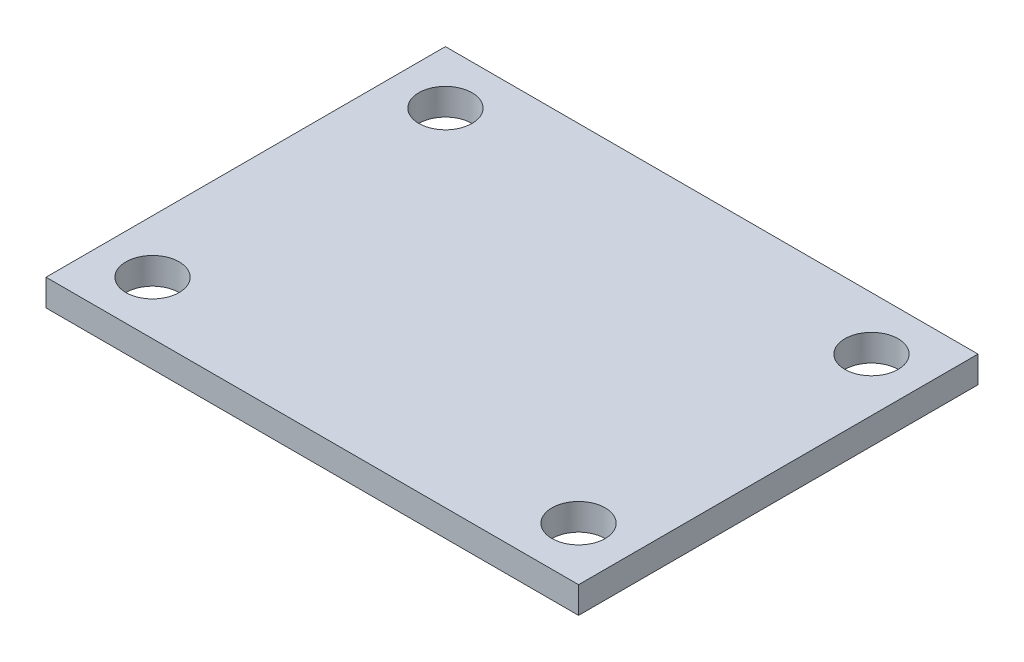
ISO-10303-21;
HEADER;
FILE_DESCRIPTION(('STEP AP214'),'2;1');
FILE_NAME('part.step','',(''),(''),'','','');
FILE_SCHEMA(('AUTOMOTIVE_DESIGN { 1 0 10303 214 1 1 1 1 }'));
ENDSEC;
DATA;
#1=APPLICATION_CONTEXT('core data for automotive mechanical design processes');
#2=APPLICATION_PROTOCOL_DEFINITION('international standard','automotive_design',2000,#1);
#3=PRODUCT_CONTEXT('',#1,'mechanical');
#4=PRODUCT('Part','Part','',(#3));
#5=PRODUCT_RELATED_PRODUCT_CATEGORY('part','',(#4));
#6=PRODUCT_DEFINITION_FORMATION('','',#4);
#7=PRODUCT_DEFINITION_CONTEXT('part definition',#1,'design');
#8=PRODUCT_DEFINITION('design','',#6,#7);
#9=PRODUCT_DEFINITION_SHAPE('','',#8);
#10=(LENGTH_UNIT() NAMED_UNIT(*) SI_UNIT(.MILLI.,.METRE.));
#11=(NAMED_UNIT(*) PLANE_ANGLE_UNIT() SI_UNIT($,.RADIAN.));
#12=(NAMED_UNIT(*) SI_UNIT($,.STERADIAN.) SOLID_ANGLE_UNIT());
#13=UNCERTAINTY_MEASURE_WITH_UNIT(LENGTH_MEASURE(1.E-05),#10,'distance_accuracy_value','');
#14=(GEOMETRIC_REPRESENTATION_CONTEXT(3) GLOBAL_UNCERTAINTY_ASSIGNED_CONTEXT((#13)) GLOBAL_UNIT_ASSIGNED_CONTEXT((#10,
#11,#12)) REPRESENTATION_CONTEXT('',''));
#15=CARTESIAN_POINT('',(0.,0.,0.));
#16=DIRECTION('',(0.,0.,1.));
#17=DIRECTION('',(1.,0.,0.));
#18=AXIS2_PLACEMENT_3D('',#15,#16,#17);
#19=CARTESIAN_POINT('',(100.,10.,75.));
#20=DIRECTION('',(-1.,0.,0.));
#21=DIRECTION('',(0.,0.,1.));
#22=AXIS2_PLACEMENT_3D('',#19,#20,#21);
#23=PLANE('',#22);
#24=DIRECTION('',(0.,0.,-1.));
#25=VECTOR('',#24,1.);
#26=CARTESIAN_POINT('',(100.,0.,75.));
#27=LINE('',#26,#25);
#28=CARTESIAN_POINT('',(100.,0.,75.));
#29=VERTEX_POINT('',#28);
#30=CARTESIAN_POINT('',(100.,0.,-75.));
#31=VERTEX_POINT('',#30);
#32=EDGE_CURVE('E98',#29,#31,#27,.T.);
#33=ORIENTED_EDGE('',*,*,#32,.T.);
#34=DIRECTION('',(0.,-1.,0.));
#35=VECTOR('',#34,1.);
#36=CARTESIAN_POINT('',(100.,10.,-75.));
#37=LINE('',#36,#35);
#38=CARTESIAN_POINT('',(100.,10.,-75.));
#39=VERTEX_POINT('',#38);
#40=EDGE_CURVE('E11',#39,#31,#37,.T.);
#41=ORIENTED_EDGE('',*,*,#40,.F.);
#42=DIRECTION('',(0.,0.,-1.));
#43=VECTOR('',#42,1.);
#44=CARTESIAN_POINT('',(100.,10.,75.));
#45=LINE('',#44,#43);
#46=CARTESIAN_POINT('',(100.,10.,75.));
#47=VERTEX_POINT('',#46);
#48=EDGE_CURVE('E85',#47,#39,#45,.T.);
#49=ORIENTED_EDGE('',*,*,#48,.F.);
#50=DIRECTION('',(0.,-1.,0.));
#51=VECTOR('',#50,1.);
#52=CARTESIAN_POINT('',(100.,10.,75.));
#53=LINE('',#52,#51);
#54=EDGE_CURVE('E94',#47,#29,#53,.T.);
#55=ORIENTED_EDGE('',*,*,#54,.T.);
#56=EDGE_LOOP('',(#33,#41,#49,#55));
#57=FACE_BOUND('',#56,.T.);
#58=ADVANCED_FACE('F32',(#57),#23,.F.);
#59=CARTESIAN_POINT('',(-100.,10.,-75.));
#60=DIRECTION('',(0.,0.,1.));
#61=DIRECTION('',(1.,0.,0.));
#62=AXIS2_PLACEMENT_3D('',#59,#60,#61);
#63=PLANE('',#62);
#64=DIRECTION('',(-1.,0.,0.));
#65=VECTOR('',#64,1.);
#66=CARTESIAN_POINT('',(-100.,0.,-75.));
#67=LINE('',#66,#65);
#68=CARTESIAN_POINT('',(-100.,0.,-75.));
#69=VERTEX_POINT('',#68);
#70=EDGE_CURVE('E89',#31,#69,#67,.T.);
#71=ORIENTED_EDGE('',*,*,#70,.T.);
#72=DIRECTION('',(0.,-1.,0.));
#73=VECTOR('',#72,1.);
#74=CARTESIAN_POINT('',(-100.,10.,-75.));
#75=LINE('',#74,#73);
#76=CARTESIAN_POINT('',(-100.,10.,-75.));
#77=VERTEX_POINT('',#76);
#78=EDGE_CURVE('E41',#77,#69,#75,.T.);
#79=ORIENTED_EDGE('',*,*,#78,.F.);
#80=DIRECTION('',(-1.,0.,0.));
#81=VECTOR('',#80,1.);
#82=CARTESIAN_POINT('',(-100.,10.,-75.));
#83=LINE('',#82,#81);
#84=EDGE_CURVE('E80',#39,#77,#83,.T.);
#85=ORIENTED_EDGE('',*,*,#84,.F.);
#86=ORIENTED_EDGE('',*,*,#40,.T.);
#87=EDGE_LOOP('',(#71,#79,#85,#86));
#88=FACE_BOUND('',#87,.T.);
#89=ADVANCED_FACE('F88',(#88),#63,.F.);
#90=CARTESIAN_POINT('',(-100.,10.,75.));
#91=DIRECTION('',(1.,0.,0.));
#92=DIRECTION('',(0.,0.,-1.));
#93=AXIS2_PLACEMENT_3D('',#90,#91,#92);
#94=PLANE('',#93);
#95=DIRECTION('',(0.,0.,1.));
#96=VECTOR('',#95,1.);
#97=CARTESIAN_POINT('',(-100.,0.,75.));
#98=LINE('',#97,#96);
#99=CARTESIAN_POINT('',(-100.,0.,75.));
#100=VERTEX_POINT('',#99);
#101=EDGE_CURVE('E67',#69,#100,#98,.T.);
#102=ORIENTED_EDGE('',*,*,#101,.T.);
#103=DIRECTION('',(0.,-1.,0.));
#104=VECTOR('',#103,1.);
#105=CARTESIAN_POINT('',(-100.,10.,75.));
#106=LINE('',#105,#104);
#107=CARTESIAN_POINT('',(-100.,10.,75.));
#108=VERTEX_POINT('',#107);
#109=EDGE_CURVE('E90',#108,#100,#106,.T.);
#110=ORIENTED_EDGE('',*,*,#109,.F.);
#111=DIRECTION('',(0.,0.,1.));
#112=VECTOR('',#111,1.);
#113=CARTESIAN_POINT('',(-100.,10.,75.));
#114=LINE('',#113,#112);
#115=EDGE_CURVE('E83',#77,#108,#114,.T.);
#116=ORIENTED_EDGE('',*,*,#115,.F.);
#117=ORIENTED_EDGE('',*,*,#78,.T.);
#118=EDGE_LOOP('',(#102,#110,#116,#117));
#119=FACE_BOUND('',#118,.T.);
#120=ADVANCED_FACE('F92',(#119),#94,.F.);
#121=CARTESIAN_POINT('',(-100.,10.,75.));
#122=DIRECTION('',(0.,0.,-1.));
#123=DIRECTION('',(-1.,0.,0.));
#124=AXIS2_PLACEMENT_3D('',#121,#122,#123);
#125=PLANE('',#124);
#126=DIRECTION('',(1.,0.,0.));
#127=VECTOR('',#126,1.);
#128=CARTESIAN_POINT('',(-100.,0.,75.));
#129=LINE('',#128,#127);
#130=EDGE_CURVE('E73',#100,#29,#129,.T.);
#131=ORIENTED_EDGE('',*,*,#130,.T.);
#132=ORIENTED_EDGE('',*,*,#54,.F.);
#133=DIRECTION('',(1.,0.,0.));
#134=VECTOR('',#133,1.);
#135=CARTESIAN_POINT('',(-100.,10.,75.));
#136=LINE('',#135,#134);
#137=EDGE_CURVE('E50',#108,#47,#136,.T.);
#138=ORIENTED_EDGE('',*,*,#137,.F.);
#139=ORIENTED_EDGE('',*,*,#109,.T.);
#140=EDGE_LOOP('',(#131,#132,#138,#139));
#141=FACE_BOUND('',#140,.T.);
#142=ADVANCED_FACE('F135',(#141),#125,.F.);
#143=CARTESIAN_POINT('',(0.,10.,0.));
#144=DIRECTION('',(0.,-1.,0.));
#145=DIRECTION('',(0.,0.,-1.));
#146=AXIS2_PLACEMENT_3D('',#143,#144,#145);
#147=PLANE('',#146);
#148=CARTESIAN_POINT('',(80.,10.,55.));
#149=DIRECTION('',(0.,1.,0.));
#150=DIRECTION('',(0.,0.,1.));
#151=AXIS2_PLACEMENT_3D('',#148,#149,#150);
#152=CIRCLE('',#151,9.99999999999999);
#153=CARTESIAN_POINT('',(80.,10.,65.));
#154=VERTEX_POINT('',#153);
#155=EDGE_CURVE('E125',#154,#154,#152,.T.);
#156=ORIENTED_EDGE('',*,*,#155,.F.);
#157=EDGE_LOOP('',(#156));
#158=FACE_BOUND('',#157,.T.);
#159=CARTESIAN_POINT('',(-80.,10.,55.));
#160=DIRECTION('',(0.,1.,0.));
#161=DIRECTION('',(0.,0.,1.));
#162=AXIS2_PLACEMENT_3D('',#159,#160,#161);
#163=CIRCLE('',#162,9.99999999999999);
#164=CARTESIAN_POINT('',(-80.,10.,65.));
#165=VERTEX_POINT('',#164);
#166=EDGE_CURVE('E115',#165,#165,#163,.T.);
#167=ORIENTED_EDGE('',*,*,#166,.F.);
#168=EDGE_LOOP('',(#167));
#169=FACE_BOUND('',#168,.T.);
#170=CARTESIAN_POINT('',(80.,10.,-55.));
#171=DIRECTION('',(0.,1.,0.));
#172=DIRECTION('',(0.,0.,1.));
#173=AXIS2_PLACEMENT_3D('',#170,#171,#172);
#174=CIRCLE('',#173,9.99999999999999);
#175=CARTESIAN_POINT('',(80.,10.,-45.));
#176=VERTEX_POINT('',#175);
#177=EDGE_CURVE('E112',#176,#176,#174,.T.);
#178=ORIENTED_EDGE('',*,*,#177,.F.);
#179=EDGE_LOOP('',(#178));
#180=FACE_BOUND('',#179,.T.);
#181=CARTESIAN_POINT('',(-80.,10.,-55.));
#182=DIRECTION('',(0.,1.,0.));
#183=DIRECTION('',(0.,0.,1.));
#184=AXIS2_PLACEMENT_3D('',#181,#182,#183);
#185=CIRCLE('',#184,9.99999999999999);
#186=CARTESIAN_POINT('',(-80.,10.,-45.));
#187=VERTEX_POINT('',#186);
#188=EDGE_CURVE('E109',#187,#187,#185,.T.);
#189=ORIENTED_EDGE('',*,*,#188,.F.);
#190=EDGE_LOOP('',(#189));
#191=FACE_BOUND('',#190,.T.);
#192=ORIENTED_EDGE('',*,*,#48,.T.);
#193=ORIENTED_EDGE('',*,*,#84,.T.);
#194=ORIENTED_EDGE('',*,*,#115,.T.);
#195=ORIENTED_EDGE('',*,*,#137,.T.);
#196=EDGE_LOOP('',(#192,#193,#194,#195));
#197=FACE_BOUND('',#196,.T.);
#198=ADVANCED_FACE('F81',(#158,#169,#180,#191,#197),#147,.F.);
#199=CARTESIAN_POINT('',(0.,0.,0.));
#200=DIRECTION('',(0.,-1.,0.));
#201=DIRECTION('',(0.,0.,-1.));
#202=AXIS2_PLACEMENT_3D('',#199,#200,#201);
#203=PLANE('',#202);
#204=CARTESIAN_POINT('',(80.,0.,55.));
#205=DIRECTION('',(0.,-1.,0.));
#206=DIRECTION('',(0.,0.,-1.));
#207=AXIS2_PLACEMENT_3D('',#204,#205,#206);
#208=CIRCLE('',#207,9.99999999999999);
#209=CARTESIAN_POINT('',(80.,0.,45.));
#210=VERTEX_POINT('',#209);
#211=EDGE_CURVE('E35',#210,#210,#208,.T.);
#212=ORIENTED_EDGE('',*,*,#211,.F.);
#213=EDGE_LOOP('',(#212));
#214=FACE_BOUND('',#213,.T.);
#215=CARTESIAN_POINT('',(-80.,0.,55.));
#216=DIRECTION('',(0.,-1.,0.));
#217=DIRECTION('',(0.,0.,-1.));
#218=AXIS2_PLACEMENT_3D('',#215,#216,#217);
#219=CIRCLE('',#218,9.99999999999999);
#220=CARTESIAN_POINT('',(-80.,0.,45.));
#221=VERTEX_POINT('',#220);
#222=EDGE_CURVE('E113',#221,#221,#219,.T.);
#223=ORIENTED_EDGE('',*,*,#222,.F.);
#224=EDGE_LOOP('',(#223));
#225=FACE_BOUND('',#224,.T.);
#226=CARTESIAN_POINT('',(80.,0.,-55.));
#227=DIRECTION('',(0.,-1.,0.));
#228=DIRECTION('',(0.,0.,-1.));
#229=AXIS2_PLACEMENT_3D('',#226,#227,#228);
#230=CIRCLE('',#229,9.99999999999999);
#231=CARTESIAN_POINT('',(80.,0.,-65.));
#232=VERTEX_POINT('',#231);
#233=EDGE_CURVE('E110',#232,#232,#230,.T.);
#234=ORIENTED_EDGE('',*,*,#233,.F.);
#235=EDGE_LOOP('',(#234));
#236=FACE_BOUND('',#235,.T.);
#237=CARTESIAN_POINT('',(-80.,0.,-55.));
#238=DIRECTION('',(0.,-1.,0.));
#239=DIRECTION('',(0.,0.,-1.));
#240=AXIS2_PLACEMENT_3D('',#237,#238,#239);
#241=CIRCLE('',#240,9.99999999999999);
#242=CARTESIAN_POINT('',(-80.,0.,-65.));
#243=VERTEX_POINT('',#242);
#244=EDGE_CURVE('E101',#243,#243,#241,.T.);
#245=ORIENTED_EDGE('',*,*,#244,.F.);
#246=EDGE_LOOP('',(#245));
#247=FACE_BOUND('',#246,.T.);
#248=ORIENTED_EDGE('',*,*,#32,.F.);
#249=ORIENTED_EDGE('',*,*,#130,.F.);
#250=ORIENTED_EDGE('',*,*,#101,.F.);
#251=ORIENTED_EDGE('',*,*,#70,.F.);
#252=EDGE_LOOP('',(#248,#249,#250,#251));
#253=FACE_BOUND('',#252,.T.);
#254=ADVANCED_FACE('F134',(#214,#225,#236,#247,#253),#203,.T.);
#255=CARTESIAN_POINT('',(-80.,-10.,-55.));
#256=DIRECTION('',(0.,1.,0.));
#257=DIRECTION('',(0.,0.,1.));
#258=AXIS2_PLACEMENT_3D('',#255,#256,#257);
#259=CYLINDRICAL_SURFACE('',#258,9.99999999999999);
#260=ORIENTED_EDGE('',*,*,#244,.T.);
#261=EDGE_LOOP('',(#260));
#262=FACE_BOUND('',#261,.T.);
#263=ORIENTED_EDGE('',*,*,#188,.T.);
#264=EDGE_LOOP('',(#263));
#265=FACE_BOUND('',#264,.T.);
#266=ADVANCED_FACE('F131',(#262,#265),#259,.F.);
#267=CARTESIAN_POINT('',(80.,-10.,-55.));
#268=DIRECTION('',(0.,1.,0.));
#269=DIRECTION('',(0.,0.,1.));
#270=AXIS2_PLACEMENT_3D('',#267,#268,#269);
#271=CYLINDRICAL_SURFACE('',#270,9.99999999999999);
#272=ORIENTED_EDGE('',*,*,#233,.T.);
#273=EDGE_LOOP('',(#272));
#274=FACE_BOUND('',#273,.T.);
#275=ORIENTED_EDGE('',*,*,#177,.T.);
#276=EDGE_LOOP('',(#275));
#277=FACE_BOUND('',#276,.T.);
#278=ADVANCED_FACE('F184',(#274,#277),#271,.F.);
#279=CARTESIAN_POINT('',(-80.,-10.,55.));
#280=DIRECTION('',(0.,1.,0.));
#281=DIRECTION('',(0.,0.,1.));
#282=AXIS2_PLACEMENT_3D('',#279,#280,#281);
#283=CYLINDRICAL_SURFACE('',#282,9.99999999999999);
#284=ORIENTED_EDGE('',*,*,#222,.T.);
#285=EDGE_LOOP('',(#284));
#286=FACE_BOUND('',#285,.T.);
#287=ORIENTED_EDGE('',*,*,#166,.T.);
#288=EDGE_LOOP('',(#287));
#289=FACE_BOUND('',#288,.T.);
#290=ADVANCED_FACE('F193',(#286,#289),#283,.F.);
#291=CARTESIAN_POINT('',(80.,-10.,55.));
#292=DIRECTION('',(0.,1.,0.));
#293=DIRECTION('',(0.,0.,1.));
#294=AXIS2_PLACEMENT_3D('',#291,#292,#293);
#295=CYLINDRICAL_SURFACE('',#294,9.99999999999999);
#296=ORIENTED_EDGE('',*,*,#211,.T.);
#297=EDGE_LOOP('',(#296));
#298=FACE_BOUND('',#297,.T.);
#299=ORIENTED_EDGE('',*,*,#155,.T.);
#300=EDGE_LOOP('',(#299));
#301=FACE_BOUND('',#300,.T.);
#302=ADVANCED_FACE('F203',(#298,#301),#295,.F.);
#303=CLOSED_SHELL('',(#58,#89,#120,#142,#198,#254,#266,#278,#290,#302));
#304=MANIFOLD_SOLID_BREP('B2',#303);
#305=ADVANCED_BREP_SHAPE_REPRESENTATION('',(#18,#304),#14);
#306=SHAPE_DEFINITION_REPRESENTATION(#9,#305);
ENDSEC;
END-ISO-10303-21;
